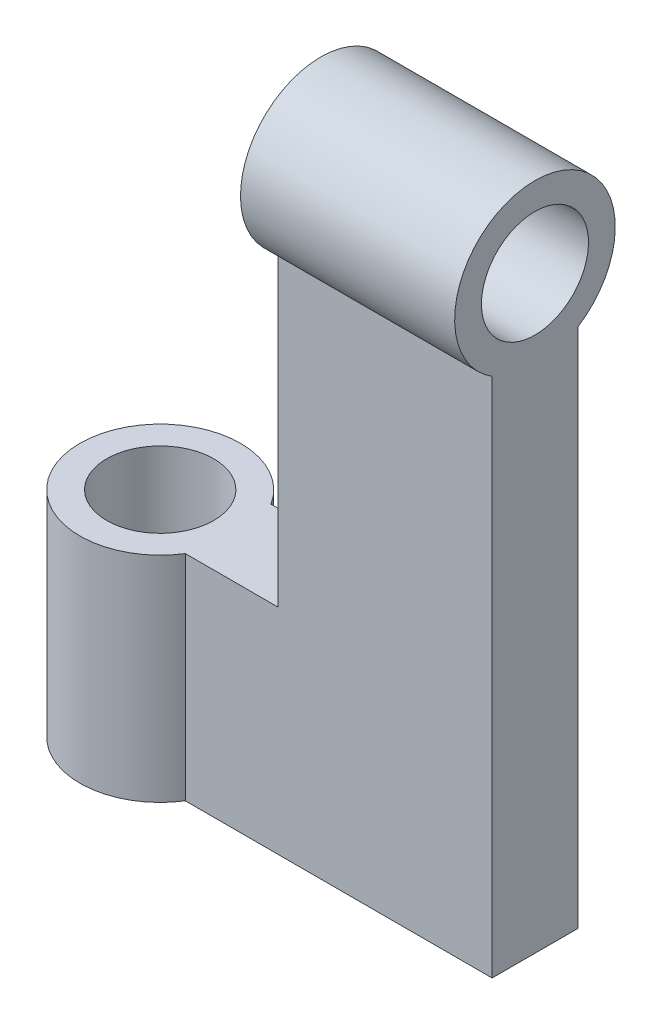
ISO-10303-21;
HEADER;
FILE_DESCRIPTION(('STEP AP214'),'2;1');
FILE_NAME('part.step','',(''),(''),'','','');
FILE_SCHEMA(('AUTOMOTIVE_DESIGN { 1 0 10303 214 1 1 1 1 }'));
ENDSEC;
DATA;
#1=APPLICATION_CONTEXT('core data for automotive mechanical design processes');
#2=APPLICATION_PROTOCOL_DEFINITION('international standard','automotive_design',2000,#1);
#3=PRODUCT_CONTEXT('',#1,'mechanical');
#4=PRODUCT('Part','Part','',(#3));
#5=PRODUCT_RELATED_PRODUCT_CATEGORY('part','',(#4));
#6=PRODUCT_DEFINITION_FORMATION('','',#4);
#7=PRODUCT_DEFINITION_CONTEXT('part definition',#1,'design');
#8=PRODUCT_DEFINITION('design','',#6,#7);
#9=PRODUCT_DEFINITION_SHAPE('','',#8);
#10=(LENGTH_UNIT() NAMED_UNIT(*) SI_UNIT(.MILLI.,.METRE.));
#11=(NAMED_UNIT(*) PLANE_ANGLE_UNIT() SI_UNIT($,.RADIAN.));
#12=(NAMED_UNIT(*) SI_UNIT($,.STERADIAN.) SOLID_ANGLE_UNIT());
#13=UNCERTAINTY_MEASURE_WITH_UNIT(LENGTH_MEASURE(1.E-05),#10,'distance_accuracy_value','');
#14=(GEOMETRIC_REPRESENTATION_CONTEXT(3) GLOBAL_UNCERTAINTY_ASSIGNED_CONTEXT((#13)) GLOBAL_UNIT_ASSIGNED_CONTEXT((#10,
#11,#12)) REPRESENTATION_CONTEXT('',''));
#15=CARTESIAN_POINT('',(0.,0.,0.));
#16=DIRECTION('',(0.,0.,1.));
#17=DIRECTION('',(1.,0.,0.));
#18=AXIS2_PLACEMENT_3D('',#15,#16,#17);
#19=CARTESIAN_POINT('',(-48.1115533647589,-17.1147004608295,8.));
#20=DIRECTION('',(-1.,0.,0.));
#21=DIRECTION('',(0.,0.,1.));
#22=AXIS2_PLACEMENT_3D('',#19,#20,#21);
#23=PLANE('',#22);
#24=DIRECTION('',(0.,1.,0.));
#25=VECTOR('',#24,1.);
#26=CARTESIAN_POINT('',(-48.1115533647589,-17.1147004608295,0.));
#27=LINE('',#26,#25);
#28=CARTESIAN_POINT('',(-48.1115533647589,-17.1147004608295,0.));
#29=VERTEX_POINT('',#28);
#30=CARTESIAN_POINT('',(-48.1115533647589,31.5410107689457,0.));
#31=VERTEX_POINT('',#30);
#32=EDGE_CURVE('E87',#29,#31,#27,.T.);
#33=ORIENTED_EDGE('',*,*,#32,.T.);
#34=CARTESIAN_POINT('',(-48.1115533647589,37.8852995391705,4.));
#35=DIRECTION('',(1.,0.,0.));
#36=DIRECTION('',(0.,1.,0.));
#37=AXIS2_PLACEMENT_3D('',#34,#35,#36);
#38=CIRCLE('',#37,7.50000000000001);
#39=CARTESIAN_POINT('',(-48.1115533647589,31.5410107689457,8.));
#40=VERTEX_POINT('',#39);
#41=EDGE_CURVE('E133',#31,#40,#38,.T.);
#42=ORIENTED_EDGE('',*,*,#41,.T.);
#43=DIRECTION('',(0.,1.,0.));
#44=VECTOR('',#43,1.);
#45=CARTESIAN_POINT('',(-48.1115533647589,-17.1147004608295,8.));
#46=LINE('',#45,#44);
#47=CARTESIAN_POINT('',(-48.1115533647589,-17.1147004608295,8.));
#48=VERTEX_POINT('',#47);
#49=EDGE_CURVE('E80',#48,#40,#46,.T.);
#50=ORIENTED_EDGE('',*,*,#49,.F.);
#51=DIRECTION('',(0.,0.,-1.));
#52=VECTOR('',#51,1.);
#53=CARTESIAN_POINT('',(-48.1115533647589,-17.1147004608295,8.));
#54=LINE('',#53,#52);
#55=EDGE_CURVE('E73',#48,#29,#54,.T.);
#56=ORIENTED_EDGE('',*,*,#55,.T.);
#57=EDGE_LOOP('',(#33,#42,#50,#56));
#58=FACE_BOUND('',#57,.T.);
#59=CARTESIAN_POINT('',(-48.1115533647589,37.8852995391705,4.));
#60=DIRECTION('',(1.,0.,0.));
#61=DIRECTION('',(0.,1.,0.));
#62=AXIS2_PLACEMENT_3D('',#59,#60,#61);
#63=CIRCLE('',#62,5.00000000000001);
#64=CARTESIAN_POINT('',(-48.1115533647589,42.8852995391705,4.));
#65=VERTEX_POINT('',#64);
#66=EDGE_CURVE('E137',#65,#65,#63,.T.);
#67=ORIENTED_EDGE('',*,*,#66,.F.);
#68=EDGE_LOOP('',(#67));
#69=FACE_BOUND('',#68,.T.);
#70=ADVANCED_FACE('F34',(#58,#69),#23,.F.);
#71=CARTESIAN_POINT('',(-68.1115533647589,32.8852995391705,8.));
#72=DIRECTION('',(1.,0.,0.));
#73=DIRECTION('',(0.,1.,0.));
#74=AXIS2_PLACEMENT_3D('',#71,#72,#73);
#75=PLANE('',#74);
#76=CARTESIAN_POINT('',(-68.1115533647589,37.8852995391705,4.));
#77=DIRECTION('',(1.,0.,0.));
#78=DIRECTION('',(0.,1.,0.));
#79=AXIS2_PLACEMENT_3D('',#76,#77,#78);
#80=CIRCLE('',#79,5.00000000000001);
#81=CARTESIAN_POINT('',(-68.1115533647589,42.8852995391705,4.));
#82=VERTEX_POINT('',#81);
#83=EDGE_CURVE('E136',#82,#82,#80,.F.);
#84=ORIENTED_EDGE('',*,*,#83,.F.);
#85=EDGE_LOOP('',(#84));
#86=FACE_BOUND('',#85,.T.);
#87=DIRECTION('',(0.,-1.,0.));
#88=VECTOR('',#87,1.);
#89=CARTESIAN_POINT('',(-68.1115533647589,32.8852995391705,8.));
#90=LINE('',#89,#88);
#91=CARTESIAN_POINT('',(-68.1115533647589,31.5410107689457,8.));
#92=VERTEX_POINT('',#91);
#93=CARTESIAN_POINT('',(-68.1115533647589,2.88529953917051,8.));
#94=VERTEX_POINT('',#93);
#95=EDGE_CURVE('E147',#92,#94,#90,.T.);
#96=ORIENTED_EDGE('',*,*,#95,.F.);
#97=CARTESIAN_POINT('',(-68.1115533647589,37.8852995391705,4.));
#98=DIRECTION('',(1.,0.,0.));
#99=DIRECTION('',(0.,1.,0.));
#100=AXIS2_PLACEMENT_3D('',#97,#98,#99);
#101=CIRCLE('',#100,7.50000000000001);
#102=CARTESIAN_POINT('',(-68.1115533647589,31.5410107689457,0.));
#103=VERTEX_POINT('',#102);
#104=EDGE_CURVE('E48',#92,#103,#101,.F.);
#105=ORIENTED_EDGE('',*,*,#104,.T.);
#106=DIRECTION('',(0.,-1.,0.));
#107=VECTOR('',#106,1.);
#108=CARTESIAN_POINT('',(-68.1115533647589,32.8852995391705,0.));
#109=LINE('',#108,#107);
#110=CARTESIAN_POINT('',(-68.1115533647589,2.88529953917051,0.));
#111=VERTEX_POINT('',#110);
#112=EDGE_CURVE('E93',#103,#111,#109,.T.);
#113=ORIENTED_EDGE('',*,*,#112,.T.);
#114=DIRECTION('',(0.,0.,-1.));
#115=VECTOR('',#114,1.);
#116=CARTESIAN_POINT('',(-68.1115533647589,2.88529953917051,8.));
#117=LINE('',#116,#115);
#118=EDGE_CURVE('E88',#94,#111,#117,.T.);
#119=ORIENTED_EDGE('',*,*,#118,.F.);
#120=EDGE_LOOP('',(#96,#105,#113,#119));
#121=FACE_BOUND('',#120,.T.);
#122=ADVANCED_FACE('F170',(#86,#121),#75,.F.);
#123=CARTESIAN_POINT('',(-78.1115533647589,2.88529953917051,8.));
#124=DIRECTION('',(0.,-1.,0.));
#125=DIRECTION('',(1.,0.,0.));
#126=AXIS2_PLACEMENT_3D('',#123,#124,#125);
#127=PLANE('',#126);
#128=DIRECTION('',(-1.,0.,0.));
#129=VECTOR('',#128,1.);
#130=CARTESIAN_POINT('',(-78.1115533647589,2.88529953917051,0.));
#131=LINE('',#130,#129);
#132=CARTESIAN_POINT('',(-76.7672645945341,2.88529953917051,0.));
#133=VERTEX_POINT('',#132);
#134=EDGE_CURVE('E81',#111,#133,#131,.T.);
#135=ORIENTED_EDGE('',*,*,#134,.T.);
#136=CARTESIAN_POINT('',(-83.1115533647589,2.88529953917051,4.));
#137=DIRECTION('',(0.,-1.,0.));
#138=DIRECTION('',(1.,0.,0.));
#139=AXIS2_PLACEMENT_3D('',#136,#137,#138);
#140=CIRCLE('',#139,7.50000000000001);
#141=CARTESIAN_POINT('',(-76.7672645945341,2.88529953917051,8.));
#142=VERTEX_POINT('',#141);
#143=EDGE_CURVE('E123',#133,#142,#140,.F.);
#144=ORIENTED_EDGE('',*,*,#143,.T.);
#145=DIRECTION('',(-1.,0.,0.));
#146=VECTOR('',#145,1.);
#147=CARTESIAN_POINT('',(-78.1115533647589,2.88529953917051,8.));
#148=LINE('',#147,#146);
#149=EDGE_CURVE('E114',#94,#142,#148,.T.);
#150=ORIENTED_EDGE('',*,*,#149,.F.);
#151=ORIENTED_EDGE('',*,*,#118,.T.);
#152=EDGE_LOOP('',(#135,#144,#150,#151));
#153=FACE_BOUND('',#152,.T.);
#154=CARTESIAN_POINT('',(-83.1115533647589,2.88529953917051,4.));
#155=DIRECTION('',(0.,-1.,0.));
#156=DIRECTION('',(1.,0.,0.));
#157=AXIS2_PLACEMENT_3D('',#154,#155,#156);
#158=CIRCLE('',#157,5.);
#159=CARTESIAN_POINT('',(-78.1115533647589,2.88529953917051,4.));
#160=VERTEX_POINT('',#159);
#161=EDGE_CURVE('E150',#160,#160,#158,.F.);
#162=ORIENTED_EDGE('',*,*,#161,.F.);
#163=EDGE_LOOP('',(#162));
#164=FACE_BOUND('',#163,.T.);
#165=ADVANCED_FACE('F109',(#153,#164),#127,.F.);
#166=CARTESIAN_POINT('',(-78.1115533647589,-17.1147004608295,8.));
#167=DIRECTION('',(0.,1.,0.));
#168=DIRECTION('',(-1.,0.,0.));
#169=AXIS2_PLACEMENT_3D('',#166,#167,#168);
#170=PLANE('',#169);
#171=CARTESIAN_POINT('',(-83.1115533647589,-17.1147004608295,4.));
#172=DIRECTION('',(0.,-1.,0.));
#173=DIRECTION('',(1.,0.,0.));
#174=AXIS2_PLACEMENT_3D('',#171,#172,#173);
#175=CIRCLE('',#174,5.);
#176=CARTESIAN_POINT('',(-78.1115533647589,-17.1147004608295,4.));
#177=VERTEX_POINT('',#176);
#178=EDGE_CURVE('E155',#177,#177,#175,.T.);
#179=ORIENTED_EDGE('',*,*,#178,.F.);
#180=EDGE_LOOP('',(#179));
#181=FACE_BOUND('',#180,.T.);
#182=DIRECTION('',(1.,0.,0.));
#183=VECTOR('',#182,1.);
#184=CARTESIAN_POINT('',(-78.1115533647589,-17.1147004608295,8.));
#185=LINE('',#184,#183);
#186=CARTESIAN_POINT('',(-76.7672645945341,-17.1147004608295,8.));
#187=VERTEX_POINT('',#186);
#188=EDGE_CURVE('E57',#187,#48,#185,.T.);
#189=ORIENTED_EDGE('',*,*,#188,.F.);
#190=CARTESIAN_POINT('',(-83.1115533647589,-17.1147004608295,4.));
#191=DIRECTION('',(0.,-1.,0.));
#192=DIRECTION('',(1.,0.,0.));
#193=AXIS2_PLACEMENT_3D('',#190,#191,#192);
#194=CIRCLE('',#193,7.50000000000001);
#195=CARTESIAN_POINT('',(-76.7672645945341,-17.1147004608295,0.));
#196=VERTEX_POINT('',#195);
#197=EDGE_CURVE('E77',#187,#196,#194,.T.);
#198=ORIENTED_EDGE('',*,*,#197,.T.);
#199=DIRECTION('',(1.,0.,0.));
#200=VECTOR('',#199,1.);
#201=CARTESIAN_POINT('',(-78.1115533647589,-17.1147004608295,0.));
#202=LINE('',#201,#200);
#203=EDGE_CURVE('E70',#196,#29,#202,.T.);
#204=ORIENTED_EDGE('',*,*,#203,.T.);
#205=ORIENTED_EDGE('',*,*,#55,.F.);
#206=EDGE_LOOP('',(#189,#198,#204,#205));
#207=FACE_BOUND('',#206,.T.);
#208=ADVANCED_FACE('F72',(#181,#207),#170,.F.);
#209=CARTESIAN_POINT('',(0.,0.,8.));
#210=DIRECTION('',(0.,0.,1.));
#211=DIRECTION('',(1.,0.,0.));
#212=AXIS2_PLACEMENT_3D('',#209,#210,#211);
#213=PLANE('',#212);
#214=DIRECTION('',(0.,-1.,0.));
#215=VECTOR('',#214,1.);
#216=CARTESIAN_POINT('',(-76.7672645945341,24.098502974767,8.));
#217=LINE('',#216,#215);
#218=EDGE_CURVE('E142',#187,#142,#217,.F.);
#219=ORIENTED_EDGE('',*,*,#218,.F.);
#220=ORIENTED_EDGE('',*,*,#188,.T.);
#221=ORIENTED_EDGE('',*,*,#49,.T.);
#222=DIRECTION('',(1.,0.,0.));
#223=VECTOR('',#222,1.);
#224=CARTESIAN_POINT('',(-89.3247568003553,31.5410107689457,8.));
#225=LINE('',#224,#223);
#226=EDGE_CURVE('E94',#92,#40,#225,.T.);
#227=ORIENTED_EDGE('',*,*,#226,.F.);
#228=ORIENTED_EDGE('',*,*,#95,.T.);
#229=ORIENTED_EDGE('',*,*,#149,.T.);
#230=EDGE_LOOP('',(#219,#220,#221,#227,#228,#229));
#231=FACE_BOUND('',#230,.T.);
#232=ADVANCED_FACE('F148',(#231),#213,.T.);
#233=CARTESIAN_POINT('',(0.,0.,0.));
#234=DIRECTION('',(0.,0.,1.));
#235=DIRECTION('',(1.,0.,0.));
#236=AXIS2_PLACEMENT_3D('',#233,#234,#235);
#237=PLANE('',#236);
#238=ORIENTED_EDGE('',*,*,#203,.F.);
#239=DIRECTION('',(0.,-1.,0.));
#240=VECTOR('',#239,1.);
#241=CARTESIAN_POINT('',(-76.7672645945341,24.098502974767,0.));
#242=LINE('',#241,#240);
#243=EDGE_CURVE('E11',#196,#133,#242,.F.);
#244=ORIENTED_EDGE('',*,*,#243,.T.);
#245=ORIENTED_EDGE('',*,*,#134,.F.);
#246=ORIENTED_EDGE('',*,*,#112,.F.);
#247=DIRECTION('',(1.,0.,0.));
#248=VECTOR('',#247,1.);
#249=CARTESIAN_POINT('',(-89.3247568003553,31.5410107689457,0.));
#250=LINE('',#249,#248);
#251=EDGE_CURVE('E41',#103,#31,#250,.T.);
#252=ORIENTED_EDGE('',*,*,#251,.T.);
#253=ORIENTED_EDGE('',*,*,#32,.F.);
#254=EDGE_LOOP('',(#238,#244,#245,#246,#252,#253));
#255=FACE_BOUND('',#254,.T.);
#256=ADVANCED_FACE('F91',(#255),#237,.F.);
#257=CARTESIAN_POINT('',(-89.3247568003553,37.8852995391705,4.));
#258=DIRECTION('',(1.,0.,0.));
#259=DIRECTION('',(0.,1.,0.));
#260=AXIS2_PLACEMENT_3D('',#257,#258,#259);
#261=CYLINDRICAL_SURFACE('',#260,7.50000000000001);
#262=ORIENTED_EDGE('',*,*,#104,.F.);
#263=ORIENTED_EDGE('',*,*,#226,.T.);
#264=ORIENTED_EDGE('',*,*,#41,.F.);
#265=ORIENTED_EDGE('',*,*,#251,.F.);
#266=EDGE_LOOP('',(#262,#263,#264,#265));
#267=FACE_BOUND('',#266,.T.);
#268=ADVANCED_FACE('F134',(#267),#261,.T.);
#269=CARTESIAN_POINT('',(-89.3247568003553,37.8852995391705,4.));
#270=DIRECTION('',(1.,0.,0.));
#271=DIRECTION('',(0.,1.,0.));
#272=AXIS2_PLACEMENT_3D('',#269,#270,#271);
#273=CYLINDRICAL_SURFACE('',#272,5.00000000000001);
#274=CARTESIAN_POINT('',(-48.1115533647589,42.8852995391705,4.));
#275=CARTESIAN_POINT('',(-48.3198866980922,42.8852995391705,4.));
#276=CARTESIAN_POINT('',(-48.5282200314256,42.8852995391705,4.));
#277=CARTESIAN_POINT('',(-48.9448866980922,42.8852995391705,4.));
#278=CARTESIAN_POINT('',(-49.1532200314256,42.8852995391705,4.));
#279=CARTESIAN_POINT('',(-49.5698866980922,42.8852995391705,4.));
#280=CARTESIAN_POINT('',(-49.7782200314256,42.8852995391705,4.));
#281=CARTESIAN_POINT('',(-50.1948866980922,42.8852995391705,4.));
#282=CARTESIAN_POINT('',(-50.4032200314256,42.8852995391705,4.));
#283=CARTESIAN_POINT('',(-50.8198866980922,42.8852995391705,4.));
#284=CARTESIAN_POINT('',(-51.0282200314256,42.8852995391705,4.));
#285=CARTESIAN_POINT('',(-51.4448866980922,42.8852995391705,4.));
#286=CARTESIAN_POINT('',(-51.6532200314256,42.8852995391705,4.));
#287=CARTESIAN_POINT('',(-52.0698866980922,42.8852995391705,4.));
#288=CARTESIAN_POINT('',(-52.2782200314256,42.8852995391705,4.));
#289=CARTESIAN_POINT('',(-52.6948866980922,42.8852995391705,4.));
#290=CARTESIAN_POINT('',(-52.9032200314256,42.8852995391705,4.));
#291=CARTESIAN_POINT('',(-53.3198866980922,42.8852995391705,4.));
#292=CARTESIAN_POINT('',(-53.5282200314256,42.8852995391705,4.));
#293=CARTESIAN_POINT('',(-53.9448866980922,42.8852995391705,4.));
#294=CARTESIAN_POINT('',(-54.1532200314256,42.8852995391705,4.));
#295=CARTESIAN_POINT('',(-54.5698866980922,42.8852995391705,4.));
#296=CARTESIAN_POINT('',(-54.7782200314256,42.8852995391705,4.));
#297=CARTESIAN_POINT('',(-55.1948866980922,42.8852995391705,4.));
#298=CARTESIAN_POINT('',(-55.4032200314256,42.8852995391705,4.));
#299=CARTESIAN_POINT('',(-55.8198866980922,42.8852995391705,4.));
#300=CARTESIAN_POINT('',(-56.0282200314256,42.8852995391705,4.));
#301=CARTESIAN_POINT('',(-56.4448866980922,42.8852995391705,4.));
#302=CARTESIAN_POINT('',(-56.6532200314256,42.8852995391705,4.));
#303=CARTESIAN_POINT('',(-57.0698866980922,42.8852995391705,4.));
#304=CARTESIAN_POINT('',(-57.2782200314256,42.8852995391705,4.));
#305=CARTESIAN_POINT('',(-57.6948866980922,42.8852995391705,4.));
#306=CARTESIAN_POINT('',(-57.9032200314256,42.8852995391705,4.));
#307=CARTESIAN_POINT('',(-58.3198866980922,42.8852995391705,4.));
#308=CARTESIAN_POINT('',(-58.5282200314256,42.8852995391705,4.));
#309=CARTESIAN_POINT('',(-58.9448866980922,42.8852995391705,4.));
#310=CARTESIAN_POINT('',(-59.1532200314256,42.8852995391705,4.));
#311=CARTESIAN_POINT('',(-59.5698866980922,42.8852995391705,4.));
#312=CARTESIAN_POINT('',(-59.7782200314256,42.8852995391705,4.));
#313=CARTESIAN_POINT('',(-60.1948866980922,42.8852995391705,4.));
#314=CARTESIAN_POINT('',(-60.4032200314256,42.8852995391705,4.));
#315=CARTESIAN_POINT('',(-60.8198866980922,42.8852995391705,4.));
#316=CARTESIAN_POINT('',(-61.0282200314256,42.8852995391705,4.));
#317=CARTESIAN_POINT('',(-61.4448866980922,42.8852995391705,4.));
#318=CARTESIAN_POINT('',(-61.6532200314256,42.8852995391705,4.));
#319=CARTESIAN_POINT('',(-62.0698866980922,42.8852995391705,4.));
#320=CARTESIAN_POINT('',(-62.2782200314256,42.8852995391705,4.));
#321=CARTESIAN_POINT('',(-62.6948866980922,42.8852995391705,4.));
#322=CARTESIAN_POINT('',(-62.9032200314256,42.8852995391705,4.));
#323=CARTESIAN_POINT('',(-63.3198866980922,42.8852995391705,4.));
#324=CARTESIAN_POINT('',(-63.5282200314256,42.8852995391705,4.));
#325=CARTESIAN_POINT('',(-63.9448866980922,42.8852995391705,4.));
#326=CARTESIAN_POINT('',(-64.1532200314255,42.8852995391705,4.));
#327=CARTESIAN_POINT('',(-64.5698866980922,42.8852995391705,4.));
#328=CARTESIAN_POINT('',(-64.7782200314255,42.8852995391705,4.));
#329=CARTESIAN_POINT('',(-65.1948866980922,42.8852995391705,4.));
#330=CARTESIAN_POINT('',(-65.4032200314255,42.8852995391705,4.));
#331=CARTESIAN_POINT('',(-65.8198866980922,42.8852995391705,4.));
#332=CARTESIAN_POINT('',(-66.0282200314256,42.8852995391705,4.));
#333=CARTESIAN_POINT('',(-66.4448866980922,42.8852995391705,4.));
#334=CARTESIAN_POINT('',(-66.6532200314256,42.8852995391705,4.));
#335=CARTESIAN_POINT('',(-67.0698866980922,42.8852995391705,4.));
#336=CARTESIAN_POINT('',(-67.2782200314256,42.8852995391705,4.));
#337=CARTESIAN_POINT('',(-67.6948866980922,42.8852995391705,4.));
#338=CARTESIAN_POINT('',(-67.9032200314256,42.8852995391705,4.));
#339=CARTESIAN_POINT('',(-68.1115533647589,42.8852995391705,4.));
#340=B_SPLINE_CURVE_WITH_KNOTS('',3,(#274,#275,#276,#277,#278,#279,#280,#281,#282,#283,#284,
#285,#286,#287,#288,#289,#290,#291,#292,#293,#294,#295,#296,#297,#298,#299,#300,#301,#302,#303,
#304,#305,#306,#307,#308,#309,#310,#311,#312,#313,#314,#315,#316,#317,#318,#319,#320,#321,#322,
#323,#324,#325,#326,#327,#328,#329,#330,#331,#332,#333,#334,#335,#336,#337,#338,#339),
.UNSPECIFIED.,.F.,.F.,(4,2,2,2,2,2,2,2,2,2,2,2,2,2,2,2,2,2,2,2,2,2,2,2,2,2,2,2,2,2,2,2,4),(0.,
0.625000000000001,1.25,1.875,2.5,3.125,3.75,4.375,5.,5.62500000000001,6.25000000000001,
6.87500000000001,7.50000000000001,8.12500000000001,8.75000000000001,9.37500000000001,10.,10.625,
11.25,11.875,12.5,13.125,13.75,14.375,15.,15.625,16.25,16.875,17.5,18.125,18.75,19.375,20.),.UNSPECIFIED.);
#341=EDGE_CURVE('BSEAM182',#65,#82,#340,.T.);
#342=ORIENTED_EDGE('',*,*,#66,.T.);
#343=ORIENTED_EDGE('',*,*,#83,.T.);
#344=ORIENTED_EDGE('',*,*,#341,.T.);
#345=ORIENTED_EDGE('',*,*,#341,.F.);
#346=EDGE_LOOP('',(#342,#344,#343,#345));
#347=FACE_BOUND('',#346,.T.);
#348=ADVANCED_FACE('F182',(#347),#273,.F.);
#349=CARTESIAN_POINT('',(-83.1115533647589,24.098502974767,4.));
#350=DIRECTION('',(0.,-1.,0.));
#351=DIRECTION('',(1.,0.,0.));
#352=AXIS2_PLACEMENT_3D('',#349,#350,#351);
#353=CYLINDRICAL_SURFACE('',#352,7.50000000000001);
#354=ORIENTED_EDGE('',*,*,#197,.F.);
#355=ORIENTED_EDGE('',*,*,#218,.T.);
#356=ORIENTED_EDGE('',*,*,#143,.F.);
#357=ORIENTED_EDGE('',*,*,#243,.F.);
#358=EDGE_LOOP('',(#354,#355,#356,#357));
#359=FACE_BOUND('',#358,.T.);
#360=ADVANCED_FACE('F120',(#359),#353,.T.);
#361=CARTESIAN_POINT('',(-83.1115533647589,24.098502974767,4.));
#362=DIRECTION('',(0.,-1.,0.));
#363=DIRECTION('',(1.,0.,0.));
#364=AXIS2_PLACEMENT_3D('',#361,#362,#363);
#365=CYLINDRICAL_SURFACE('',#364,5.);
#366=ORIENTED_EDGE('',*,*,#178,.T.);
#367=EDGE_LOOP('',(#366));
#368=FACE_BOUND('',#367,.T.);
#369=ORIENTED_EDGE('',*,*,#161,.T.);
#370=EDGE_LOOP('',(#369));
#371=FACE_BOUND('',#370,.T.);
#372=ADVANCED_FACE('F160',(#368,#371),#365,.F.);
#373=CLOSED_SHELL('',(#70,#122,#165,#208,#232,#256,#268,#348,#360,#372));
#374=MANIFOLD_SOLID_BREP('B2',#373);
#375=ADVANCED_BREP_SHAPE_REPRESENTATION('',(#18,#374),#14);
#376=SHAPE_DEFINITION_REPRESENTATION(#9,#375);
ENDSEC;
END-ISO-10303-21;
